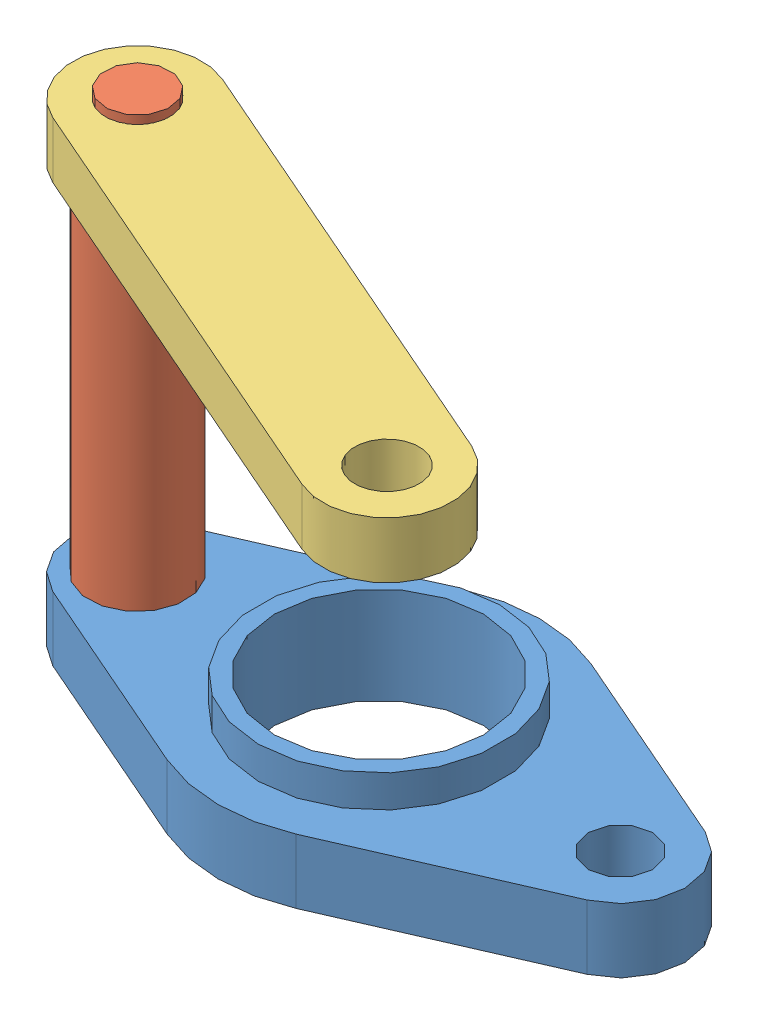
SolidWorks assembly Parallel Constraint.SLDASM, configuration Default (file format 8000). Lengths in mm.
Overall size (196.33 150 136.33).
3 component instances, 3 part files, 5 mates.
Components (placement in the parent):
- base-1: base.SLDPRT [Default] at origin size (190 30 100)
- pin-1: pin.SLDPRT [Default] at (-10.804 0 38.7798) x (0.855947 0 0.517064) z (-0.517064 0 0.855947) size (30 150 30)
- upper link-1: upper link.SLDPRT [Default] at (-6.2614 130 30) x (-0.916515 0 -0.4) z (0 1 0) size (190 40 17.5)
Mates (geometry in assembly coordinates):
- Concentric1: concentric aligned: cylinder of pin-1 through (-75 0 0) axis (0 -1 0) radius 10; cylinder of upper link-1 through (-75 147.5 0) axis (0 -1 0) radius 10
- Coincident7: coincident anti-aligned: plane of pin-1 through (-62.1608 130 7.756) normal (0 1 0); plane of upper link-1 through (-75 130 0) normal (0 -1 0)
- Concentric2: concentric aligned: cylinder of base-1 through (-75 20 0) axis (0 -1 0) radius 10; cylinder of pin-1 through (-75 0 0) axis (0 -1 0) radius 10
- Coincident8: coincident anti-aligned: plane of base-1 through (-167.5297 20 0.5275) normal (0 1 0); plane of pin-1 through (-66.4405 20 5.1706) normal (0 -1 0)
- Parallel2: parallel aligned: plane of base-1 through (-160.5315 20 -15.5072) normal (-0.4 0 0.916515); plane of upper link-1 through (-83 147.5 18.3303) normal (-0.4 0 0.916515)
